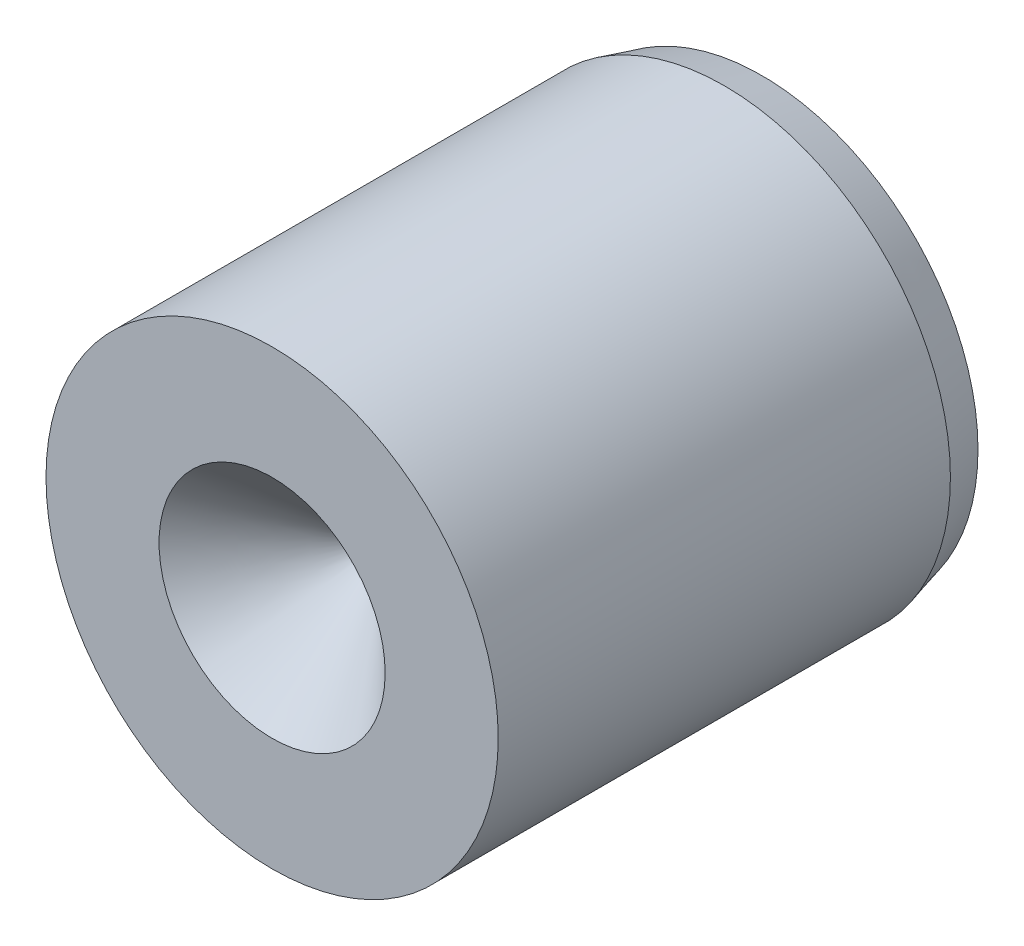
ISO-10303-21;
HEADER;
FILE_DESCRIPTION(('STEP AP214'),'2;1');
FILE_NAME('part.step','',(''),(''),'','','');
FILE_SCHEMA(('AUTOMOTIVE_DESIGN { 1 0 10303 214 1 1 1 1 }'));
ENDSEC;
DATA;
#1=APPLICATION_CONTEXT('core data for automotive mechanical design processes');
#2=APPLICATION_PROTOCOL_DEFINITION('international standard','automotive_design',2000,#1);
#3=PRODUCT_CONTEXT('',#1,'mechanical');
#4=PRODUCT('Part','Part','',(#3));
#5=PRODUCT_RELATED_PRODUCT_CATEGORY('part','',(#4));
#6=PRODUCT_DEFINITION_FORMATION('','',#4);
#7=PRODUCT_DEFINITION_CONTEXT('part definition',#1,'design');
#8=PRODUCT_DEFINITION('design','',#6,#7);
#9=PRODUCT_DEFINITION_SHAPE('','',#8);
#10=(LENGTH_UNIT() NAMED_UNIT(*) SI_UNIT(.MILLI.,.METRE.));
#11=(NAMED_UNIT(*) PLANE_ANGLE_UNIT() SI_UNIT($,.RADIAN.));
#12=(NAMED_UNIT(*) SI_UNIT($,.STERADIAN.) SOLID_ANGLE_UNIT());
#13=UNCERTAINTY_MEASURE_WITH_UNIT(LENGTH_MEASURE(1.E-05),#10,'distance_accuracy_value','');
#14=(GEOMETRIC_REPRESENTATION_CONTEXT(3) GLOBAL_UNCERTAINTY_ASSIGNED_CONTEXT((#13)) GLOBAL_UNIT_ASSIGNED_CONTEXT((#10,
#11,#12)) REPRESENTATION_CONTEXT('',''));
#15=CARTESIAN_POINT('',(0.,0.,0.));
#16=DIRECTION('',(0.,0.,1.));
#17=DIRECTION('',(1.,0.,0.));
#18=AXIS2_PLACEMENT_3D('',#15,#16,#17);
#19=CARTESIAN_POINT('',(0.,12.,26.));
#20=DIRECTION('',(0.,0.,-1.));
#21=DIRECTION('',(-1.,0.,0.));
#22=AXIS2_PLACEMENT_3D('',#19,#20,#21);
#23=PLANE('',#22);
#24=CARTESIAN_POINT('',(0.,0.,26.));
#25=DIRECTION('',(0.,0.,1.));
#26=DIRECTION('',(1.,0.,0.));
#27=AXIS2_PLACEMENT_3D('',#24,#25,#26);
#28=CIRCLE('',#27,6.);
#29=CARTESIAN_POINT('',(6.,0.,26.));
#30=VERTEX_POINT('',#29);
#31=EDGE_CURVE('E30',#30,#30,#28,.T.);
#32=ORIENTED_EDGE('',*,*,#31,.F.);
#33=EDGE_LOOP('',(#32));
#34=FACE_BOUND('',#33,.T.);
#35=CARTESIAN_POINT('',(0.,0.,26.));
#36=DIRECTION('',(0.,0.,1.));
#37=DIRECTION('',(1.,0.,0.));
#38=AXIS2_PLACEMENT_3D('',#35,#36,#37);
#39=CIRCLE('',#38,12.);
#40=CARTESIAN_POINT('',(12.,0.,26.));
#41=VERTEX_POINT('',#40);
#42=EDGE_CURVE('E9',#41,#41,#39,.T.);
#43=ORIENTED_EDGE('',*,*,#42,.T.);
#44=EDGE_LOOP('',(#43));
#45=FACE_BOUND('',#44,.T.);
#46=ADVANCED_FACE('F14',(#34,#45),#23,.F.);
#47=CARTESIAN_POINT('',(0.,0.,7.));
#48=DIRECTION('',(0.,0.,1.));
#49=DIRECTION('',(1.,0.,0.));
#50=AXIS2_PLACEMENT_3D('',#47,#48,#49);
#51=CYLINDRICAL_SURFACE('',#50,12.);
#52=CARTESIAN_POINT('',(0.,0.,2.));
#53=DIRECTION('',(0.,0.,1.));
#54=DIRECTION('',(1.,0.,0.));
#55=AXIS2_PLACEMENT_3D('',#52,#53,#54);
#56=CIRCLE('',#55,12.);
#57=CARTESIAN_POINT('',(12.,0.,2.));
#58=VERTEX_POINT('',#57);
#59=EDGE_CURVE('E20',#58,#58,#56,.T.);
#60=ORIENTED_EDGE('',*,*,#59,.T.);
#61=EDGE_LOOP('',(#60));
#62=FACE_BOUND('',#61,.T.);
#63=ORIENTED_EDGE('',*,*,#42,.F.);
#64=EDGE_LOOP('',(#63));
#65=FACE_BOUND('',#64,.T.);
#66=ADVANCED_FACE('F39',(#62,#65),#51,.T.);
#67=CARTESIAN_POINT('',(0.,0.,2.));
#68=DIRECTION('',(0.,0.,1.));
#69=DIRECTION('',(1.,0.,0.));
#70=AXIS2_PLACEMENT_3D('',#67,#68,#69);
#71=CONICAL_SURFACE('',#70,12.,0.26179938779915);
#72=CARTESIAN_POINT('',(0.,0.,0.));
#73=DIRECTION('',(0.,0.,1.));
#74=DIRECTION('',(1.,0.,0.));
#75=AXIS2_PLACEMENT_3D('',#72,#73,#74);
#76=CIRCLE('',#75,11.4641016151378);
#77=CARTESIAN_POINT('',(11.4641016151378,0.,0.));
#78=VERTEX_POINT('',#77);
#79=EDGE_CURVE('E32',#78,#78,#76,.T.);
#80=ORIENTED_EDGE('',*,*,#79,.T.);
#81=EDGE_LOOP('',(#80));
#82=FACE_BOUND('',#81,.T.);
#83=ORIENTED_EDGE('',*,*,#59,.F.);
#84=EDGE_LOOP('',(#83));
#85=FACE_BOUND('',#84,.T.);
#86=ADVANCED_FACE('F42',(#82,#85),#71,.T.);
#87=CARTESIAN_POINT('',(0.,11.4641016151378,0.));
#88=DIRECTION('',(0.,0.,-1.));
#89=DIRECTION('',(-1.,0.,0.));
#90=AXIS2_PLACEMENT_3D('',#87,#88,#89);
#91=PLANE('',#90);
#92=ORIENTED_EDGE('',*,*,#79,.F.);
#93=EDGE_LOOP('',(#92));
#94=FACE_BOUND('',#93,.T.);
#95=ADVANCED_FACE('F26',(#94),#91,.T.);
#96=CARTESIAN_POINT('',(0.,0.,26.));
#97=DIRECTION('',(0.,0.,1.));
#98=DIRECTION('',(1.,0.,0.));
#99=AXIS2_PLACEMENT_3D('',#96,#97,#98);
#100=CONICAL_SURFACE('',#99,6.,0.78539816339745);
#101=CARTESIAN_POINT('',(0.,0.,20.));
#102=VERTEX_POINT('',#101);
#103=VERTEX_LOOP('',#102);
#104=FACE_BOUND('',#103,.T.);
#105=ORIENTED_EDGE('',*,*,#31,.T.);
#106=EDGE_LOOP('',(#105));
#107=FACE_BOUND('',#106,.T.);
#108=ADVANCED_FACE('F23',(#104,#107),#100,.F.);
#109=CLOSED_SHELL('',(#46,#66,#86,#95,#108));
#110=MANIFOLD_SOLID_BREP('B1',#109);
#111=ADVANCED_BREP_SHAPE_REPRESENTATION('',(#18,#110),#14);
#112=SHAPE_DEFINITION_REPRESENTATION(#9,#111);
ENDSEC;
END-ISO-10303-21;
